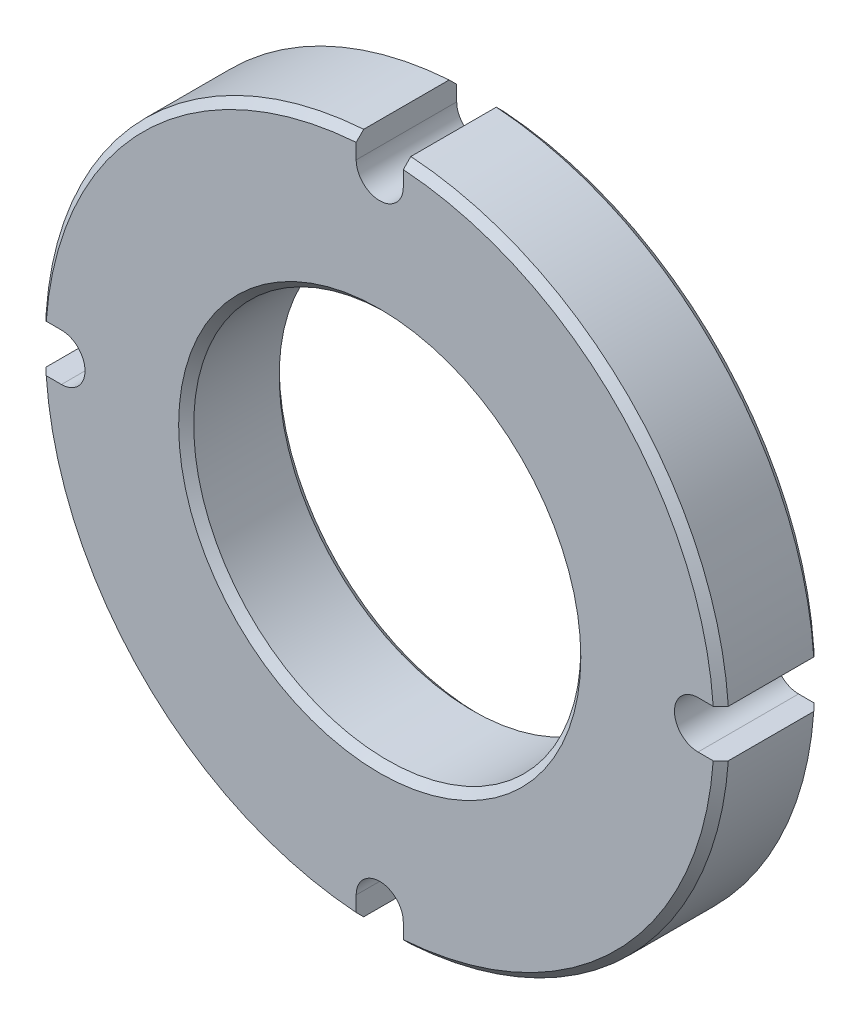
ISO-10303-21;
HEADER;
FILE_DESCRIPTION(('STEP AP214'),'2;1');
FILE_NAME('part.step','',(''),(''),'','','');
FILE_SCHEMA(('AUTOMOTIVE_DESIGN { 1 0 10303 214 1 1 1 1 }'));
ENDSEC;
DATA;
#1=APPLICATION_CONTEXT('core data for automotive mechanical design processes');
#2=APPLICATION_PROTOCOL_DEFINITION('international standard','automotive_design',2000,#1);
#3=PRODUCT_CONTEXT('',#1,'mechanical');
#4=PRODUCT('Part','Part','',(#3));
#5=PRODUCT_RELATED_PRODUCT_CATEGORY('part','',(#4));
#6=PRODUCT_DEFINITION_FORMATION('','',#4);
#7=PRODUCT_DEFINITION_CONTEXT('part definition',#1,'design');
#8=PRODUCT_DEFINITION('design','',#6,#7);
#9=PRODUCT_DEFINITION_SHAPE('','',#8);
#10=(LENGTH_UNIT() NAMED_UNIT(*) SI_UNIT(.MILLI.,.METRE.));
#11=(NAMED_UNIT(*) PLANE_ANGLE_UNIT() SI_UNIT($,.RADIAN.));
#12=(NAMED_UNIT(*) SI_UNIT($,.STERADIAN.) SOLID_ANGLE_UNIT());
#13=UNCERTAINTY_MEASURE_WITH_UNIT(LENGTH_MEASURE(1.E-05),#10,'distance_accuracy_value','');
#14=(GEOMETRIC_REPRESENTATION_CONTEXT(3) GLOBAL_UNCERTAINTY_ASSIGNED_CONTEXT((#13)) GLOBAL_UNIT_ASSIGNED_CONTEXT((#10,
#11,#12)) REPRESENTATION_CONTEXT('',''));
#15=CARTESIAN_POINT('',(0.,0.,0.));
#16=DIRECTION('',(0.,0.,1.));
#17=DIRECTION('',(1.,0.,0.));
#18=AXIS2_PLACEMENT_3D('',#15,#16,#17);
#19=CARTESIAN_POINT('',(0.,0.,2.54));
#20=DIRECTION('',(0.,0.,-1.));
#21=DIRECTION('',(-1.,0.,0.));
#22=AXIS2_PLACEMENT_3D('',#19,#20,#21);
#23=CYLINDRICAL_SURFACE('',#22,17.272);
#24=CARTESIAN_POINT('',(0.,0.,2.159));
#25=DIRECTION('',(0.,0.,1.));
#26=DIRECTION('',(1.,0.,0.));
#27=AXIS2_PLACEMENT_3D('',#24,#25,#26);
#28=CIRCLE('',#27,17.272);
#29=CARTESIAN_POINT('',(1.19062500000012,17.2309139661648,2.159));
#30=VERTEX_POINT('',#29);
#31=CARTESIAN_POINT('',(17.2309139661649,1.19062499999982,2.159));
#32=VERTEX_POINT('',#31);
#33=EDGE_CURVE('E501',#30,#32,#28,.F.);
#34=ORIENTED_EDGE('',*,*,#33,.T.);
#35=DIRECTION('',(0.,0.,-1.));
#36=VECTOR('',#35,1.);
#37=CARTESIAN_POINT('',(17.2309139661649,1.19062499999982,2.54));
#38=LINE('',#37,#36);
#39=CARTESIAN_POINT('',(17.2309139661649,1.19062499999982,-2.15900000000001));
#40=VERTEX_POINT('',#39);
#41=EDGE_CURVE('E238',#32,#40,#38,.T.);
#42=ORIENTED_EDGE('',*,*,#41,.T.);
#43=CARTESIAN_POINT('',(0.,0.,-2.15900000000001));
#44=DIRECTION('',(0.,0.,1.));
#45=DIRECTION('',(1.,0.,0.));
#46=AXIS2_PLACEMENT_3D('',#43,#44,#45);
#47=CIRCLE('',#46,17.272);
#48=CARTESIAN_POINT('',(1.19062500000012,17.2309139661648,-2.15900000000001));
#49=VERTEX_POINT('',#48);
#50=EDGE_CURVE('E415',#40,#49,#47,.T.);
#51=ORIENTED_EDGE('',*,*,#50,.T.);
#52=DIRECTION('',(0.,0.,-1.));
#53=VECTOR('',#52,1.);
#54=CARTESIAN_POINT('',(1.19062500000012,17.2309139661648,2.54));
#55=LINE('',#54,#53);
#56=EDGE_CURVE('E322',#49,#30,#55,.F.);
#57=ORIENTED_EDGE('',*,*,#56,.T.);
#58=EDGE_LOOP('',(#34,#42,#51,#57));
#59=FACE_BOUND('',#58,.T.);
#60=ADVANCED_FACE('F31',(#59),#23,.T.);
#61=CARTESIAN_POINT('',(0.,0.,-2.15900000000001));
#62=DIRECTION('',(0.,0.,1.));
#63=DIRECTION('',(1.,0.,0.));
#64=AXIS2_PLACEMENT_3D('',#61,#62,#63);
#65=CONICAL_SURFACE('',#64,17.272,0.785398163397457);
#66=CARTESIAN_POINT('',(15.2126285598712,1.19062499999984,-4.17185010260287));
#67=CARTESIAN_POINT('',(15.7859811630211,1.19062499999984,-3.6002129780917));
#68=CARTESIAN_POINT('',(16.3592616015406,1.19062499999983,-3.02850350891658));
#69=CARTESIAN_POINT('',(17.505678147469,1.19062499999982,-1.88493988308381));
#70=CARTESIAN_POINT('',(18.0788142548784,1.19062499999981,-1.31308572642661));
#71=CARTESIAN_POINT('',(18.651878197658,1.19062499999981,-0.741159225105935));
#72=B_SPLINE_CURVE_WITH_KNOTS('',3,(#66,#67,#68,#69,#70,#71),.UNSPECIFIED.,.F.,.F.,(4,2,4),(0.,
2.42889267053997,4.85778533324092),.UNSPECIFIED.);
#73=CARTESIAN_POINT('',(16.8489849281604,1.19062499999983,-2.54));
#74=VERTEX_POINT('',#73);
#75=EDGE_CURVE('E465',#74,#40,#72,.T.);
#76=ORIENTED_EDGE('',*,*,#75,.F.);
#77=CARTESIAN_POINT('',(0.,0.,-2.54));
#78=DIRECTION('',(0.,0.,1.));
#79=DIRECTION('',(1.,0.,0.));
#80=AXIS2_PLACEMENT_3D('',#77,#78,#79);
#81=CIRCLE('',#80,16.891);
#82=CARTESIAN_POINT('',(1.19062500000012,16.8489849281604,-2.54));
#83=VERTEX_POINT('',#82);
#84=EDGE_CURVE('E462',#83,#74,#81,.F.);
#85=ORIENTED_EDGE('',*,*,#84,.F.);
#86=CARTESIAN_POINT('',(1.19062500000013,18.651878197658,-0.741159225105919));
#87=CARTESIAN_POINT('',(1.19062500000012,18.0788142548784,-1.3130857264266));
#88=CARTESIAN_POINT('',(1.19062500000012,17.505678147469,-1.8849398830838));
#89=CARTESIAN_POINT('',(1.19062500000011,16.3592616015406,-3.02850350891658));
#90=CARTESIAN_POINT('',(1.19062500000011,15.785981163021,-3.60021297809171));
#91=CARTESIAN_POINT('',(1.1906250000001,15.2126285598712,-4.17185010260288));
#92=B_SPLINE_CURVE_WITH_KNOTS('',3,(#86,#87,#88,#89,#90,#91),.UNSPECIFIED.,.F.,.F.,(4,2,4),(0.,
2.42889266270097,4.85778533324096),.UNSPECIFIED.);
#93=EDGE_CURVE('E315',#49,#83,#92,.T.);
#94=ORIENTED_EDGE('',*,*,#93,.F.);
#95=ORIENTED_EDGE('',*,*,#50,.F.);
#96=EDGE_LOOP('',(#76,#85,#94,#95));
#97=FACE_BOUND('',#96,.T.);
#98=ADVANCED_FACE('F469',(#97),#65,.T.);
#99=CARTESIAN_POINT('',(0.,0.,2.54));
#100=DIRECTION('',(0.,0.,-1.));
#101=DIRECTION('',(-1.,0.,0.));
#102=AXIS2_PLACEMENT_3D('',#99,#100,#101);
#103=CONICAL_SURFACE('',#102,16.891,0.785398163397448);
#104=CARTESIAN_POINT('',(18.651878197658,1.19062499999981,0.741159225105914));
#105=CARTESIAN_POINT('',(18.0788142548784,1.19062499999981,1.3130857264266));
#106=CARTESIAN_POINT('',(17.505678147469,1.19062499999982,1.8849398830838));
#107=CARTESIAN_POINT('',(16.3592616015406,1.19062499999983,3.02850350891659));
#108=CARTESIAN_POINT('',(15.7859811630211,1.19062499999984,3.60021297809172));
#109=CARTESIAN_POINT('',(15.2126285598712,1.19062499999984,4.17185010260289));
#110=B_SPLINE_CURVE_WITH_KNOTS('',3,(#104,#105,#106,#107,#108,#109),.UNSPECIFIED.,.F.,.F.,(4,2,
4),(0.,2.42889266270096,4.85778533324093),.UNSPECIFIED.);
#111=CARTESIAN_POINT('',(16.8489849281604,1.19062499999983,2.54));
#112=VERTEX_POINT('',#111);
#113=EDGE_CURVE('E11',#32,#112,#110,.T.);
#114=ORIENTED_EDGE('',*,*,#113,.F.);
#115=ORIENTED_EDGE('',*,*,#33,.F.);
#116=CARTESIAN_POINT('',(1.1906250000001,15.2126285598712,4.1718501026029));
#117=CARTESIAN_POINT('',(1.19062500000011,15.785981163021,3.60021297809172));
#118=CARTESIAN_POINT('',(1.19062500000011,16.3592616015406,3.02850350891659));
#119=CARTESIAN_POINT('',(1.19062500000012,17.505678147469,1.88493988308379));
#120=CARTESIAN_POINT('',(1.19062500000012,18.0788142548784,1.31308572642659));
#121=CARTESIAN_POINT('',(1.19062500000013,18.651878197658,0.741159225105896));
#122=B_SPLINE_CURVE_WITH_KNOTS('',3,(#116,#117,#118,#119,#120,#121),.UNSPECIFIED.,.F.,.F.,(4,2,
4),(0.,2.42889267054,4.85778533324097),.UNSPECIFIED.);
#123=CARTESIAN_POINT('',(1.19062500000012,16.8489849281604,2.54));
#124=VERTEX_POINT('',#123);
#125=EDGE_CURVE('E300',#124,#30,#122,.T.);
#126=ORIENTED_EDGE('',*,*,#125,.F.);
#127=CARTESIAN_POINT('',(0.,0.,2.54));
#128=DIRECTION('',(0.,0.,1.));
#129=DIRECTION('',(1.,0.,0.));
#130=AXIS2_PLACEMENT_3D('',#127,#128,#129);
#131=CIRCLE('',#130,16.891);
#132=EDGE_CURVE('E59',#112,#124,#131,.T.);
#133=ORIENTED_EDGE('',*,*,#132,.F.);
#134=EDGE_LOOP('',(#114,#115,#126,#133));
#135=FACE_BOUND('',#134,.T.);
#136=ADVANCED_FACE('F265',(#135),#103,.T.);
#137=CARTESIAN_POINT('',(-17.2309139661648,1.19062500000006,2.159));
#138=VERTEX_POINT('',#137);
#139=CARTESIAN_POINT('',(-1.19062499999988,17.2309139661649,2.159));
#140=VERTEX_POINT('',#139);
#141=EDGE_CURVE('E410',#138,#140,#28,.F.);
#142=ORIENTED_EDGE('',*,*,#141,.T.);
#143=DIRECTION('',(0.,0.,-1.));
#144=VECTOR('',#143,1.);
#145=CARTESIAN_POINT('',(-1.19062499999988,17.2309139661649,2.54));
#146=LINE('',#145,#144);
#147=CARTESIAN_POINT('',(-1.19062499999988,17.2309139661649,-2.15900000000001));
#148=VERTEX_POINT('',#147);
#149=EDGE_CURVE('E321',#140,#148,#146,.T.);
#150=ORIENTED_EDGE('',*,*,#149,.T.);
#151=CARTESIAN_POINT('',(-17.2309139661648,1.19062500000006,-2.15900000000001));
#152=VERTEX_POINT('',#151);
#153=EDGE_CURVE('E514',#148,#152,#47,.T.);
#154=ORIENTED_EDGE('',*,*,#153,.T.);
#155=DIRECTION('',(0.,0.,-1.));
#156=VECTOR('',#155,1.);
#157=CARTESIAN_POINT('',(-17.2309139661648,1.19062500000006,2.54));
#158=LINE('',#157,#156);
#159=EDGE_CURVE('E352',#152,#138,#158,.F.);
#160=ORIENTED_EDGE('',*,*,#159,.T.);
#161=EDGE_LOOP('',(#142,#150,#154,#160));
#162=FACE_BOUND('',#161,.T.);
#163=ADVANCED_FACE('F499',(#162),#23,.T.);
#164=CARTESIAN_POINT('',(-1.1906249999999,15.2126285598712,-4.17185010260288));
#165=CARTESIAN_POINT('',(-1.19062499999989,15.7859811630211,-3.60021297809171));
#166=CARTESIAN_POINT('',(-1.19062499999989,16.3592616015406,-3.02850350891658));
#167=CARTESIAN_POINT('',(-1.19062499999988,17.5056781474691,-1.8849398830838));
#168=CARTESIAN_POINT('',(-1.19062499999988,18.0788142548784,-1.31308572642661));
#169=CARTESIAN_POINT('',(-1.19062499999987,18.651878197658,-0.741159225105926));
#170=B_SPLINE_CURVE_WITH_KNOTS('',3,(#164,#165,#166,#167,#168,#169),.UNSPECIFIED.,.F.,.F.,(4,2,
4),(0.,2.42889267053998,4.85778533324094),.UNSPECIFIED.);
#171=CARTESIAN_POINT('',(-1.19062499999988,16.8489849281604,-2.54));
#172=VERTEX_POINT('',#171);
#173=EDGE_CURVE('E326',#172,#148,#170,.T.);
#174=ORIENTED_EDGE('',*,*,#173,.F.);
#175=CARTESIAN_POINT('',(-16.8489849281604,1.19062500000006,-2.54));
#176=VERTEX_POINT('',#175);
#177=EDGE_CURVE('E396',#176,#172,#81,.F.);
#178=ORIENTED_EDGE('',*,*,#177,.F.);
#179=CARTESIAN_POINT('',(-18.8010404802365,1.19062500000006,-0.592297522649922));
#180=CARTESIAN_POINT('',(-18.2279852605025,1.19062500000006,-1.16423276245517));
#181=CARTESIAN_POINT('',(-17.6548597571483,1.19062500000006,-1.73609754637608));
#182=CARTESIAN_POINT('',(-16.5084681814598,1.19062500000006,-2.87968620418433));
#183=CARTESIAN_POINT('',(-15.9352021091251,1.19062500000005,-3.45141007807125));
#184=CARTESIAN_POINT('',(-15.3618657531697,1.19062500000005,-4.02306349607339));
#185=B_SPLINE_CURVE_WITH_KNOTS('',3,(#179,#180,#181,#182,#183,#184),.UNSPECIFIED.,.F.,.F.,(4,2,
4),(0.,2.42889266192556,4.85778533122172),.UNSPECIFIED.);
#186=EDGE_CURVE('E356',#152,#176,#185,.T.);
#187=ORIENTED_EDGE('',*,*,#186,.F.);
#188=ORIENTED_EDGE('',*,*,#153,.F.);
#189=EDGE_LOOP('',(#174,#178,#187,#188));
#190=FACE_BOUND('',#189,.T.);
#191=ADVANCED_FACE('F513',(#190),#65,.T.);
#192=CARTESIAN_POINT('',(-1.19062499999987,18.651878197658,0.741159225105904));
#193=CARTESIAN_POINT('',(-1.19062499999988,18.0788142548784,1.31308572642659));
#194=CARTESIAN_POINT('',(-1.19062499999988,17.505678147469,1.88493988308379));
#195=CARTESIAN_POINT('',(-1.19062499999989,16.3592616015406,3.02850350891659));
#196=CARTESIAN_POINT('',(-1.19062499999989,15.7859811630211,3.60021297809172));
#197=CARTESIAN_POINT('',(-1.1906249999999,15.2126285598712,4.17185010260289));
#198=B_SPLINE_CURVE_WITH_KNOTS('',3,(#192,#193,#194,#195,#196,#197),.UNSPECIFIED.,.F.,.F.,(4,2,
4),(0.,2.42889266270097,4.85778533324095),.UNSPECIFIED.);
#199=CARTESIAN_POINT('',(-1.19062499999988,16.8489849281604,2.54));
#200=VERTEX_POINT('',#199);
#201=EDGE_CURVE('E254',#140,#200,#198,.T.);
#202=ORIENTED_EDGE('',*,*,#201,.F.);
#203=ORIENTED_EDGE('',*,*,#141,.F.);
#204=CARTESIAN_POINT('',(-15.3618657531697,1.19062500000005,4.02306349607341));
#205=CARTESIAN_POINT('',(-15.9352021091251,1.19062500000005,3.45141007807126));
#206=CARTESIAN_POINT('',(-16.5084681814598,1.19062500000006,2.87968620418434));
#207=CARTESIAN_POINT('',(-17.6548597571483,1.19062500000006,1.73609754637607));
#208=CARTESIAN_POINT('',(-18.2279852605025,1.19062500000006,1.16423276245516));
#209=CARTESIAN_POINT('',(-18.8010404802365,1.19062500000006,0.592297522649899));
#210=B_SPLINE_CURVE_WITH_KNOTS('',3,(#204,#205,#206,#207,#208,#209),.UNSPECIFIED.,.F.,.F.,(4,2,
4),(0.,2.42889266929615,4.85778533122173),.UNSPECIFIED.);
#211=CARTESIAN_POINT('',(-16.8489849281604,1.19062500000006,2.54));
#212=VERTEX_POINT('',#211);
#213=EDGE_CURVE('E287',#212,#138,#210,.T.);
#214=ORIENTED_EDGE('',*,*,#213,.F.);
#215=EDGE_CURVE('E418',#200,#212,#131,.T.);
#216=ORIENTED_EDGE('',*,*,#215,.F.);
#217=EDGE_LOOP('',(#202,#203,#214,#216));
#218=FACE_BOUND('',#217,.T.);
#219=ADVANCED_FACE('F435',(#218),#103,.T.);
#220=CARTESIAN_POINT('',(-1.190625,-17.2309139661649,2.159));
#221=VERTEX_POINT('',#220);
#222=CARTESIAN_POINT('',(-17.2309139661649,-1.19062499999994,2.159));
#223=VERTEX_POINT('',#222);
#224=EDGE_CURVE('E406',#221,#223,#28,.F.);
#225=ORIENTED_EDGE('',*,*,#224,.T.);
#226=DIRECTION('',(0.,0.,-1.));
#227=VECTOR('',#226,1.);
#228=CARTESIAN_POINT('',(-17.2309139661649,-1.19062499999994,2.54));
#229=LINE('',#228,#227);
#230=CARTESIAN_POINT('',(-17.2309139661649,-1.19062499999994,-2.15900000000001));
#231=VERTEX_POINT('',#230);
#232=EDGE_CURVE('E361',#223,#231,#229,.T.);
#233=ORIENTED_EDGE('',*,*,#232,.T.);
#234=CARTESIAN_POINT('',(-1.190625,-17.2309139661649,-2.15900000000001));
#235=VERTEX_POINT('',#234);
#236=EDGE_CURVE('E409',#231,#235,#47,.T.);
#237=ORIENTED_EDGE('',*,*,#236,.T.);
#238=DIRECTION('',(0.,0.,-1.));
#239=VECTOR('',#238,1.);
#240=CARTESIAN_POINT('',(-1.190625,-17.2309139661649,2.54));
#241=LINE('',#240,#239);
#242=EDGE_CURVE('E521',#235,#221,#241,.F.);
#243=ORIENTED_EDGE('',*,*,#242,.T.);
#244=EDGE_LOOP('',(#225,#233,#237,#243));
#245=FACE_BOUND('',#244,.T.);
#246=ADVANCED_FACE('F520',(#245),#23,.T.);
#247=CARTESIAN_POINT('',(-15.3618657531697,-1.19062499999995,-4.02306349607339));
#248=CARTESIAN_POINT('',(-15.9352021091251,-1.19062499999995,-3.45141007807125));
#249=CARTESIAN_POINT('',(-16.5084681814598,-1.19062499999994,-2.87968620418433));
#250=CARTESIAN_POINT('',(-17.6548597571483,-1.19062499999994,-1.73609754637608));
#251=CARTESIAN_POINT('',(-18.2279852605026,-1.19062499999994,-1.16423276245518));
#252=CARTESIAN_POINT('',(-18.8010404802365,-1.19062499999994,-0.592297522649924));
#253=B_SPLINE_CURVE_WITH_KNOTS('',3,(#247,#248,#249,#250,#251,#252),.UNSPECIFIED.,.F.,.F.,(4,2,
4),(0.,2.42889266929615,4.85778533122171),.UNSPECIFIED.);
#254=CARTESIAN_POINT('',(-16.8489849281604,-1.19062499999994,-2.54));
#255=VERTEX_POINT('',#254);
#256=EDGE_CURVE('E549',#255,#231,#253,.T.);
#257=ORIENTED_EDGE('',*,*,#256,.F.);
#258=CARTESIAN_POINT('',(-1.190625,-16.8489849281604,-2.54));
#259=VERTEX_POINT('',#258);
#260=EDGE_CURVE('E392',#259,#255,#81,.F.);
#261=ORIENTED_EDGE('',*,*,#260,.F.);
#262=CARTESIAN_POINT('',(-1.190625,-18.8010404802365,-0.592297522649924));
#263=CARTESIAN_POINT('',(-1.190625,-18.2279852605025,-1.16423276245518));
#264=CARTESIAN_POINT('',(-1.190625,-17.6548597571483,-1.73609754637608));
#265=CARTESIAN_POINT('',(-1.190625,-16.5084681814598,-2.87968620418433));
#266=CARTESIAN_POINT('',(-1.190625,-15.9352021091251,-3.45141007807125));
#267=CARTESIAN_POINT('',(-1.190625,-15.3618657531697,-4.0230634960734));
#268=B_SPLINE_CURVE_WITH_KNOTS('',3,(#262,#263,#264,#265,#266,#267),.UNSPECIFIED.,.F.,.F.,(4,2,
4),(0.,2.42889266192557,4.85778533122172),.UNSPECIFIED.);
#269=EDGE_CURVE('E528',#235,#259,#268,.T.);
#270=ORIENTED_EDGE('',*,*,#269,.F.);
#271=ORIENTED_EDGE('',*,*,#236,.F.);
#272=EDGE_LOOP('',(#257,#261,#270,#271));
#273=FACE_BOUND('',#272,.T.);
#274=ADVANCED_FACE('F534',(#273),#65,.T.);
#275=CARTESIAN_POINT('',(-18.8010404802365,-1.19062499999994,0.592297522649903));
#276=CARTESIAN_POINT('',(-18.2279852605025,-1.19062499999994,1.16423276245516));
#277=CARTESIAN_POINT('',(-17.6548597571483,-1.19062499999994,1.73609754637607));
#278=CARTESIAN_POINT('',(-16.5084681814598,-1.19062499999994,2.87968620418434));
#279=CARTESIAN_POINT('',(-15.9352021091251,-1.19062499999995,3.45141007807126));
#280=CARTESIAN_POINT('',(-15.3618657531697,-1.19062499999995,4.02306349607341));
#281=B_SPLINE_CURVE_WITH_KNOTS('',3,(#275,#276,#277,#278,#279,#280),.UNSPECIFIED.,.F.,.F.,(4,2,
4),(0.,2.42889266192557,4.85778533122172),.UNSPECIFIED.);
#282=CARTESIAN_POINT('',(-16.8489849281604,-1.19062499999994,2.54));
#283=VERTEX_POINT('',#282);
#284=EDGE_CURVE('E294',#223,#283,#281,.T.);
#285=ORIENTED_EDGE('',*,*,#284,.F.);
#286=ORIENTED_EDGE('',*,*,#224,.F.);
#287=CARTESIAN_POINT('',(-1.190625,-15.3618657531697,4.02306349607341));
#288=CARTESIAN_POINT('',(-1.190625,-15.9352021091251,3.45141007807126));
#289=CARTESIAN_POINT('',(-1.190625,-16.5084681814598,2.87968620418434));
#290=CARTESIAN_POINT('',(-1.190625,-17.6548597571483,1.73609754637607));
#291=CARTESIAN_POINT('',(-1.190625,-18.2279852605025,1.16423276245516));
#292=CARTESIAN_POINT('',(-1.190625,-18.8010404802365,0.592297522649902));
#293=B_SPLINE_CURVE_WITH_KNOTS('',3,(#287,#288,#289,#290,#291,#292),.UNSPECIFIED.,.F.,.F.,(4,2,
4),(0.,2.42889266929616,4.85778533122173),.UNSPECIFIED.);
#294=CARTESIAN_POINT('',(-1.190625,-16.8489849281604,2.54));
#295=VERTEX_POINT('',#294);
#296=EDGE_CURVE('E271',#295,#221,#293,.T.);
#297=ORIENTED_EDGE('',*,*,#296,.F.);
#298=EDGE_CURVE('E417',#283,#295,#131,.T.);
#299=ORIENTED_EDGE('',*,*,#298,.F.);
#300=EDGE_LOOP('',(#285,#286,#297,#299));
#301=FACE_BOUND('',#300,.T.);
#302=ADVANCED_FACE('F266',(#301),#103,.T.);
#303=CARTESIAN_POINT('',(0.,0.,2.54));
#304=DIRECTION('',(0.,0.,1.));
#305=DIRECTION('',(1.,0.,0.));
#306=AXIS2_PLACEMENT_3D('',#303,#304,#305);
#307=PLANE('',#306);
#308=DIRECTION('',(-1.,0.,0.));
#309=VECTOR('',#308,1.);
#310=CARTESIAN_POINT('',(17.272,1.19062499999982,2.54));
#311=LINE('',#310,#309);
#312=CARTESIAN_POINT('',(16.081375,1.19062499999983,2.54));
#313=VERTEX_POINT('',#312);
#314=EDGE_CURVE('E218',#112,#313,#311,.T.);
#315=ORIENTED_EDGE('',*,*,#314,.F.);
#316=ORIENTED_EDGE('',*,*,#132,.T.);
#317=DIRECTION('',(0.,1.,0.));
#318=VECTOR('',#317,1.);
#319=CARTESIAN_POINT('',(1.19062500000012,17.272,2.54));
#320=LINE('',#319,#318);
#321=CARTESIAN_POINT('',(1.19062500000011,16.081375,2.54));
#322=VERTEX_POINT('',#321);
#323=EDGE_CURVE('E473',#322,#124,#320,.T.);
#324=ORIENTED_EDGE('',*,*,#323,.F.);
#325=CARTESIAN_POINT('',(1.14216440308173E-13,16.081375,2.54));
#326=DIRECTION('',(0.,0.,1.));
#327=DIRECTION('',(1.,0.,0.));
#328=AXIS2_PLACEMENT_3D('',#325,#326,#327);
#329=CIRCLE('',#328,1.190625);
#330=CARTESIAN_POINT('',(-1.19062499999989,16.081375,2.54));
#331=VERTEX_POINT('',#330);
#332=EDGE_CURVE('E471',#331,#322,#329,.T.);
#333=ORIENTED_EDGE('',*,*,#332,.F.);
#334=DIRECTION('',(0.,-1.,0.));
#335=VECTOR('',#334,1.);
#336=CARTESIAN_POINT('',(-1.19062499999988,17.272,2.54));
#337=LINE('',#336,#335);
#338=EDGE_CURVE('E428',#200,#331,#337,.T.);
#339=ORIENTED_EDGE('',*,*,#338,.F.);
#340=ORIENTED_EDGE('',*,*,#215,.T.);
#341=DIRECTION('',(-1.,0.,0.));
#342=VECTOR('',#341,1.);
#343=CARTESIAN_POINT('',(-17.272,1.19062500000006,2.54));
#344=LINE('',#343,#342);
#345=CARTESIAN_POINT('',(-16.081375,1.19062500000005,2.54));
#346=VERTEX_POINT('',#345);
#347=EDGE_CURVE('E334',#346,#212,#344,.T.);
#348=ORIENTED_EDGE('',*,*,#347,.F.);
#349=CARTESIAN_POINT('',(-16.081375,0.,2.54));
#350=DIRECTION('',(0.,0.,1.));
#351=DIRECTION('',(0.,1.,0.));
#352=AXIS2_PLACEMENT_3D('',#349,#350,#351);
#353=CIRCLE('',#352,1.190625);
#354=CARTESIAN_POINT('',(-16.081375,-1.19062499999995,2.54));
#355=VERTEX_POINT('',#354);
#356=EDGE_CURVE('E331',#355,#346,#353,.T.);
#357=ORIENTED_EDGE('',*,*,#356,.F.);
#358=DIRECTION('',(1.,0.,0.));
#359=VECTOR('',#358,1.);
#360=CARTESIAN_POINT('',(-17.272,-1.19062499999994,2.54));
#361=LINE('',#360,#359);
#362=EDGE_CURVE('E337',#283,#355,#361,.T.);
#363=ORIENTED_EDGE('',*,*,#362,.F.);
#364=ORIENTED_EDGE('',*,*,#298,.T.);
#365=DIRECTION('',(0.,-1.,0.));
#366=VECTOR('',#365,1.);
#367=CARTESIAN_POINT('',(-1.190625,-17.272,2.54));
#368=LINE('',#367,#366);
#369=CARTESIAN_POINT('',(-1.190625,-16.081375,2.54));
#370=VERTEX_POINT('',#369);
#371=EDGE_CURVE('E447',#370,#295,#368,.T.);
#372=ORIENTED_EDGE('',*,*,#371,.F.);
#373=CARTESIAN_POINT('',(0.,-16.081375,2.54));
#374=DIRECTION('',(0.,0.,1.));
#375=DIRECTION('',(-1.,0.,0.));
#376=AXIS2_PLACEMENT_3D('',#373,#374,#375);
#377=CIRCLE('',#376,1.190625);
#378=CARTESIAN_POINT('',(1.190625,-16.081375,2.54));
#379=VERTEX_POINT('',#378);
#380=EDGE_CURVE('E445',#379,#370,#377,.T.);
#381=ORIENTED_EDGE('',*,*,#380,.F.);
#382=DIRECTION('',(0.,1.,0.));
#383=VECTOR('',#382,1.);
#384=CARTESIAN_POINT('',(1.190625,-17.272,2.54));
#385=LINE('',#384,#383);
#386=CARTESIAN_POINT('',(1.190625,-16.8489849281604,2.54));
#387=VERTEX_POINT('',#386);
#388=EDGE_CURVE('E439',#387,#379,#385,.T.);
#389=ORIENTED_EDGE('',*,*,#388,.F.);
#390=CARTESIAN_POINT('',(16.8489849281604,-1.19062500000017,2.54));
#391=VERTEX_POINT('',#390);
#392=EDGE_CURVE('E217',#387,#391,#131,.T.);
#393=ORIENTED_EDGE('',*,*,#392,.T.);
#394=DIRECTION('',(1.,0.,0.));
#395=VECTOR('',#394,1.);
#396=CARTESIAN_POINT('',(17.272,-1.19062500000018,2.54));
#397=LINE('',#396,#395);
#398=CARTESIAN_POINT('',(16.081375,-1.19062500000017,2.54));
#399=VERTEX_POINT('',#398);
#400=EDGE_CURVE('E51',#399,#391,#397,.T.);
#401=ORIENTED_EDGE('',*,*,#400,.F.);
#402=CARTESIAN_POINT('',(16.081375,-1.70364293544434E-13,2.54));
#403=DIRECTION('',(0.,0.,1.));
#404=DIRECTION('',(0.,-1.,0.));
#405=AXIS2_PLACEMENT_3D('',#402,#403,#404);
#406=CIRCLE('',#405,1.190625);
#407=EDGE_CURVE('E209',#313,#399,#406,.T.);
#408=ORIENTED_EDGE('',*,*,#407,.F.);
#409=EDGE_LOOP('',(#315,#316,#324,#333,#339,#340,#348,#357,#363,#364,#372,#381,#389,#393,#401,#408));
#410=FACE_BOUND('',#409,.T.);
#411=CARTESIAN_POINT('',(0.,0.,2.54));
#412=DIRECTION('',(0.,0.,1.));
#413=DIRECTION('',(1.,0.,0.));
#414=AXIS2_PLACEMENT_3D('',#411,#412,#413);
#415=CIRCLE('',#414,10.16);
#416=CARTESIAN_POINT('',(10.16,0.,2.54));
#417=VERTEX_POINT('',#416);
#418=EDGE_CURVE('E414',#417,#417,#415,.F.);
#419=ORIENTED_EDGE('',*,*,#418,.T.);
#420=EDGE_LOOP('',(#419));
#421=FACE_BOUND('',#420,.T.);
#422=ADVANCED_FACE('F213',(#410,#421),#307,.T.);
#423=CARTESIAN_POINT('',(0.,0.,-2.54));
#424=DIRECTION('',(0.,0.,1.));
#425=DIRECTION('',(1.,0.,0.));
#426=AXIS2_PLACEMENT_3D('',#423,#424,#425);
#427=PLANE('',#426);
#428=CARTESIAN_POINT('',(0.,0.,-2.54));
#429=DIRECTION('',(0.,0.,1.));
#430=DIRECTION('',(1.,0.,0.));
#431=AXIS2_PLACEMENT_3D('',#428,#429,#430);
#432=CIRCLE('',#431,10.16);
#433=CARTESIAN_POINT('',(10.16,0.,-2.54));
#434=VERTEX_POINT('',#433);
#435=EDGE_CURVE('E395',#434,#434,#432,.T.);
#436=ORIENTED_EDGE('',*,*,#435,.T.);
#437=EDGE_LOOP('',(#436));
#438=FACE_BOUND('',#437,.T.);
#439=ORIENTED_EDGE('',*,*,#84,.T.);
#440=DIRECTION('',(-1.,0.,0.));
#441=VECTOR('',#440,1.);
#442=CARTESIAN_POINT('',(17.272,1.19062499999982,-2.54));
#443=LINE('',#442,#441);
#444=CARTESIAN_POINT('',(16.081375,1.19062499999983,-2.54));
#445=VERTEX_POINT('',#444);
#446=EDGE_CURVE('E205',#74,#445,#443,.T.);
#447=ORIENTED_EDGE('',*,*,#446,.T.);
#448=CARTESIAN_POINT('',(16.081375,-1.70364293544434E-13,-2.54));
#449=DIRECTION('',(0.,0.,1.));
#450=DIRECTION('',(0.,-1.,0.));
#451=AXIS2_PLACEMENT_3D('',#448,#449,#450);
#452=CIRCLE('',#451,1.190625);
#453=CARTESIAN_POINT('',(16.081375,-1.19062500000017,-2.54));
#454=VERTEX_POINT('',#453);
#455=EDGE_CURVE('E220',#445,#454,#452,.T.);
#456=ORIENTED_EDGE('',*,*,#455,.T.);
#457=DIRECTION('',(1.,0.,0.));
#458=VECTOR('',#457,1.);
#459=CARTESIAN_POINT('',(17.272,-1.19062500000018,-2.54));
#460=LINE('',#459,#458);
#461=CARTESIAN_POINT('',(16.8489849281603,-1.19062500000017,-2.54));
#462=VERTEX_POINT('',#461);
#463=EDGE_CURVE('E200',#454,#462,#460,.T.);
#464=ORIENTED_EDGE('',*,*,#463,.T.);
#465=CARTESIAN_POINT('',(1.190625,-16.8489849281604,-2.54));
#466=VERTEX_POINT('',#465);
#467=EDGE_CURVE('E389',#462,#466,#81,.F.);
#468=ORIENTED_EDGE('',*,*,#467,.T.);
#469=DIRECTION('',(0.,1.,0.));
#470=VECTOR('',#469,1.);
#471=CARTESIAN_POINT('',(1.190625,-17.272,-2.54));
#472=LINE('',#471,#470);
#473=CARTESIAN_POINT('',(1.190625,-16.081375,-2.54));
#474=VERTEX_POINT('',#473);
#475=EDGE_CURVE('E541',#466,#474,#472,.T.);
#476=ORIENTED_EDGE('',*,*,#475,.T.);
#477=CARTESIAN_POINT('',(0.,-16.081375,-2.54));
#478=DIRECTION('',(0.,0.,1.));
#479=DIRECTION('',(-1.,0.,0.));
#480=AXIS2_PLACEMENT_3D('',#477,#478,#479);
#481=CIRCLE('',#480,1.190625);
#482=CARTESIAN_POINT('',(-1.190625,-16.081375,-2.54));
#483=VERTEX_POINT('',#482);
#484=EDGE_CURVE('E446',#474,#483,#481,.T.);
#485=ORIENTED_EDGE('',*,*,#484,.T.);
#486=DIRECTION('',(0.,-1.,0.));
#487=VECTOR('',#486,1.);
#488=CARTESIAN_POINT('',(-1.190625,-17.272,-2.54));
#489=LINE('',#488,#487);
#490=EDGE_CURVE('E544',#483,#259,#489,.T.);
#491=ORIENTED_EDGE('',*,*,#490,.T.);
#492=ORIENTED_EDGE('',*,*,#260,.T.);
#493=DIRECTION('',(1.,0.,0.));
#494=VECTOR('',#493,1.);
#495=CARTESIAN_POINT('',(-17.272,-1.19062499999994,-2.54));
#496=LINE('',#495,#494);
#497=CARTESIAN_POINT('',(-16.081375,-1.19062499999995,-2.54));
#498=VERTEX_POINT('',#497);
#499=EDGE_CURVE('E345',#255,#498,#496,.T.);
#500=ORIENTED_EDGE('',*,*,#499,.T.);
#501=CARTESIAN_POINT('',(-16.081375,0.,-2.54));
#502=DIRECTION('',(0.,0.,1.));
#503=DIRECTION('',(0.,1.,0.));
#504=AXIS2_PLACEMENT_3D('',#501,#502,#503);
#505=CIRCLE('',#504,1.190625);
#506=CARTESIAN_POINT('',(-16.081375,1.19062500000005,-2.54));
#507=VERTEX_POINT('',#506);
#508=EDGE_CURVE('E339',#498,#507,#505,.T.);
#509=ORIENTED_EDGE('',*,*,#508,.T.);
#510=DIRECTION('',(-1.,0.,0.));
#511=VECTOR('',#510,1.);
#512=CARTESIAN_POINT('',(-17.272,1.19062500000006,-2.54));
#513=LINE('',#512,#511);
#514=EDGE_CURVE('E342',#507,#176,#513,.T.);
#515=ORIENTED_EDGE('',*,*,#514,.T.);
#516=ORIENTED_EDGE('',*,*,#177,.T.);
#517=DIRECTION('',(0.,-1.,0.));
#518=VECTOR('',#517,1.);
#519=CARTESIAN_POINT('',(-1.19062499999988,17.272,-2.54));
#520=LINE('',#519,#518);
#521=CARTESIAN_POINT('',(-1.19062499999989,16.081375,-2.54));
#522=VERTEX_POINT('',#521);
#523=EDGE_CURVE('E486',#172,#522,#520,.T.);
#524=ORIENTED_EDGE('',*,*,#523,.T.);
#525=CARTESIAN_POINT('',(1.14216440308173E-13,16.081375,-2.54));
#526=DIRECTION('',(0.,0.,1.));
#527=DIRECTION('',(1.,0.,0.));
#528=AXIS2_PLACEMENT_3D('',#525,#526,#527);
#529=CIRCLE('',#528,1.190625);
#530=CARTESIAN_POINT('',(1.19062500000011,16.081375,-2.54));
#531=VERTEX_POINT('',#530);
#532=EDGE_CURVE('E481',#522,#531,#529,.T.);
#533=ORIENTED_EDGE('',*,*,#532,.T.);
#534=DIRECTION('',(0.,1.,0.));
#535=VECTOR('',#534,1.);
#536=CARTESIAN_POINT('',(1.19062500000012,17.272,-2.54));
#537=LINE('',#536,#535);
#538=EDGE_CURVE('E484',#531,#83,#537,.T.);
#539=ORIENTED_EDGE('',*,*,#538,.T.);
#540=EDGE_LOOP('',(#439,#447,#456,#464,#468,#476,#485,#491,#492,#500,#509,#515,#516,#524,#533,#539));
#541=FACE_BOUND('',#540,.T.);
#542=ADVANCED_FACE('F457',(#438,#541),#427,.F.);
#543=CARTESIAN_POINT('',(1.190625,-17.2309139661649,-2.15900000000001));
#544=VERTEX_POINT('',#543);
#545=CARTESIAN_POINT('',(17.2309139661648,-1.19062500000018,-2.15900000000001));
#546=VERTEX_POINT('',#545);
#547=EDGE_CURVE('E411',#544,#546,#47,.T.);
#548=ORIENTED_EDGE('',*,*,#547,.T.);
#549=DIRECTION('',(0.,0.,-1.));
#550=VECTOR('',#549,1.);
#551=CARTESIAN_POINT('',(17.2309139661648,-1.19062500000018,2.54));
#552=LINE('',#551,#550);
#553=CARTESIAN_POINT('',(17.2309139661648,-1.19062500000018,2.159));
#554=VERTEX_POINT('',#553);
#555=EDGE_CURVE('E227',#546,#554,#552,.F.);
#556=ORIENTED_EDGE('',*,*,#555,.T.);
#557=CARTESIAN_POINT('',(1.190625,-17.2309139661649,2.159));
#558=VERTEX_POINT('',#557);
#559=EDGE_CURVE('E405',#554,#558,#28,.F.);
#560=ORIENTED_EDGE('',*,*,#559,.T.);
#561=DIRECTION('',(0.,0.,-1.));
#562=VECTOR('',#561,1.);
#563=CARTESIAN_POINT('',(1.190625,-17.2309139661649,2.54));
#564=LINE('',#563,#562);
#565=EDGE_CURVE('E390',#558,#544,#564,.T.);
#566=ORIENTED_EDGE('',*,*,#565,.T.);
#567=EDGE_LOOP('',(#548,#556,#560,#566));
#568=FACE_BOUND('',#567,.T.);
#569=ADVANCED_FACE('F33',(#568),#23,.T.);
#570=CARTESIAN_POINT('',(0.,0.,2.54));
#571=DIRECTION('',(0.,0.,-1.));
#572=DIRECTION('',(-1.,0.,0.));
#573=AXIS2_PLACEMENT_3D('',#570,#571,#572);
#574=CYLINDRICAL_SURFACE('',#573,9.779);
#575=CARTESIAN_POINT('',(0.,0.,-2.15899999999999));
#576=DIRECTION('',(0.,0.,1.));
#577=DIRECTION('',(1.,0.,0.));
#578=AXIS2_PLACEMENT_3D('',#575,#576,#577);
#579=CIRCLE('',#578,9.779);
#580=CARTESIAN_POINT('',(9.779,0.,-2.15899999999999));
#581=VERTEX_POINT('',#580);
#582=EDGE_CURVE('E402',#581,#581,#579,.F.);
#583=ORIENTED_EDGE('',*,*,#582,.T.);
#584=EDGE_LOOP('',(#583));
#585=FACE_BOUND('',#584,.T.);
#586=CARTESIAN_POINT('',(0.,0.,2.15900000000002));
#587=DIRECTION('',(0.,0.,1.));
#588=DIRECTION('',(1.,0.,0.));
#589=AXIS2_PLACEMENT_3D('',#586,#587,#588);
#590=CIRCLE('',#589,9.779);
#591=CARTESIAN_POINT('',(9.779,0.,2.15900000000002));
#592=VERTEX_POINT('',#591);
#593=EDGE_CURVE('E399',#592,#592,#590,.T.);
#594=ORIENTED_EDGE('',*,*,#593,.T.);
#595=EDGE_LOOP('',(#594));
#596=FACE_BOUND('',#595,.T.);
#597=ADVANCED_FACE('F568',(#585,#596),#574,.F.);
#598=CARTESIAN_POINT('',(0.,0.,-2.54));
#599=DIRECTION('',(0.,0.,-1.));
#600=DIRECTION('',(-1.,0.,0.));
#601=AXIS2_PLACEMENT_3D('',#598,#599,#600);
#602=CONICAL_SURFACE('',#601,10.16,0.785398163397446);
#603=ORIENTED_EDGE('',*,*,#582,.F.);
#604=EDGE_LOOP('',(#603));
#605=FACE_BOUND('',#604,.T.);
#606=ORIENTED_EDGE('',*,*,#435,.F.);
#607=EDGE_LOOP('',(#606));
#608=FACE_BOUND('',#607,.T.);
#609=ADVANCED_FACE('F573',(#605,#608),#602,.F.);
#610=CARTESIAN_POINT('',(18.651878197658,-1.19062500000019,-0.741159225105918));
#611=CARTESIAN_POINT('',(18.0788142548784,-1.19062500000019,-1.3130857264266));
#612=CARTESIAN_POINT('',(17.505678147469,-1.19062500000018,-1.8849398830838));
#613=CARTESIAN_POINT('',(16.3592616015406,-1.19062500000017,-3.02850350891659));
#614=CARTESIAN_POINT('',(15.785981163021,-1.19062500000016,-3.60021297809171));
#615=CARTESIAN_POINT('',(15.2126285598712,-1.19062500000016,-4.17185010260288));
#616=B_SPLINE_CURVE_WITH_KNOTS('',3,(#610,#611,#612,#613,#614,#615),.UNSPECIFIED.,.F.,.F.,(4,2,
4),(0.,2.42889266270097,4.85778533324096),.UNSPECIFIED.);
#617=EDGE_CURVE('E231',#546,#462,#616,.T.);
#618=ORIENTED_EDGE('',*,*,#617,.F.);
#619=ORIENTED_EDGE('',*,*,#547,.F.);
#620=CARTESIAN_POINT('',(1.190625,-15.3618657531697,-4.0230634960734));
#621=CARTESIAN_POINT('',(1.190625,-15.9352021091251,-3.45141007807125));
#622=CARTESIAN_POINT('',(1.190625,-16.5084681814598,-2.87968620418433));
#623=CARTESIAN_POINT('',(1.190625,-17.6548597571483,-1.73609754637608));
#624=CARTESIAN_POINT('',(1.190625,-18.2279852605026,-1.16423276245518));
#625=CARTESIAN_POINT('',(1.190625,-18.8010404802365,-0.592297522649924));
#626=B_SPLINE_CURVE_WITH_KNOTS('',3,(#620,#621,#622,#623,#624,#625),.UNSPECIFIED.,.F.,.F.,(4,2,
4),(0.,2.42889266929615,4.85778533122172),.UNSPECIFIED.);
#627=EDGE_CURVE('E383',#466,#544,#626,.T.);
#628=ORIENTED_EDGE('',*,*,#627,.F.);
#629=ORIENTED_EDGE('',*,*,#467,.F.);
#630=EDGE_LOOP('',(#618,#619,#628,#629));
#631=FACE_BOUND('',#630,.T.);
#632=ADVANCED_FACE('F240',(#631),#65,.T.);
#633=CARTESIAN_POINT('',(15.2126285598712,-1.19062500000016,4.1718501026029));
#634=CARTESIAN_POINT('',(15.785981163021,-1.19062500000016,3.60021297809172));
#635=CARTESIAN_POINT('',(16.3592616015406,-1.19062500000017,3.02850350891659));
#636=CARTESIAN_POINT('',(17.505678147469,-1.19062500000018,1.88493988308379));
#637=CARTESIAN_POINT('',(18.0788142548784,-1.19062500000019,1.31308572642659));
#638=CARTESIAN_POINT('',(18.651878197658,-1.19062500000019,0.741159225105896));
#639=B_SPLINE_CURVE_WITH_KNOTS('',3,(#633,#634,#635,#636,#637,#638),.UNSPECIFIED.,.F.,.F.,(4,2,
4),(0.,2.42889267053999,4.85778533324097),.UNSPECIFIED.);
#640=EDGE_CURVE('E44',#391,#554,#639,.T.);
#641=ORIENTED_EDGE('',*,*,#640,.F.);
#642=ORIENTED_EDGE('',*,*,#392,.F.);
#643=CARTESIAN_POINT('',(1.190625,-18.8010404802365,0.592297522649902));
#644=CARTESIAN_POINT('',(1.190625,-18.2279852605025,1.16423276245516));
#645=CARTESIAN_POINT('',(1.190625,-17.6548597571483,1.73609754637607));
#646=CARTESIAN_POINT('',(1.190625,-16.5084681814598,2.87968620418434));
#647=CARTESIAN_POINT('',(1.190625,-15.9352021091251,3.45141007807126));
#648=CARTESIAN_POINT('',(1.190625,-15.3618657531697,4.02306349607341));
#649=B_SPLINE_CURVE_WITH_KNOTS('',3,(#643,#644,#645,#646,#647,#648),.UNSPECIFIED.,.F.,.F.,(4,2,
4),(0.,2.42889266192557,4.85778533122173),.UNSPECIFIED.);
#650=EDGE_CURVE('E280',#558,#387,#649,.T.);
#651=ORIENTED_EDGE('',*,*,#650,.F.);
#652=ORIENTED_EDGE('',*,*,#559,.F.);
#653=EDGE_LOOP('',(#641,#642,#651,#652));
#654=FACE_BOUND('',#653,.T.);
#655=ADVANCED_FACE('F259',(#654),#103,.T.);
#656=CARTESIAN_POINT('',(0.,0.,2.15900000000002));
#657=DIRECTION('',(0.,0.,1.));
#658=DIRECTION('',(1.,0.,0.));
#659=AXIS2_PLACEMENT_3D('',#656,#657,#658);
#660=CONICAL_SURFACE('',#659,9.779,0.785398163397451);
#661=ORIENTED_EDGE('',*,*,#418,.F.);
#662=EDGE_LOOP('',(#661));
#663=FACE_BOUND('',#662,.T.);
#664=ORIENTED_EDGE('',*,*,#593,.F.);
#665=EDGE_LOOP('',(#664));
#666=FACE_BOUND('',#665,.T.);
#667=ADVANCED_FACE('F263',(#663,#666),#660,.F.);
#668=CARTESIAN_POINT('',(0.,-16.081375,-2.54));
#669=DIRECTION('',(0.,0.,1.));
#670=DIRECTION('',(1.,0.,0.));
#671=AXIS2_PLACEMENT_3D('',#668,#669,#670);
#672=CYLINDRICAL_SURFACE('',#671,1.190625);
#673=ORIENTED_EDGE('',*,*,#380,.T.);
#674=DIRECTION('',(0.,0.,1.));
#675=VECTOR('',#674,1.);
#676=CARTESIAN_POINT('',(-1.190625,-16.081375,-2.54));
#677=LINE('',#676,#675);
#678=EDGE_CURVE('E539',#483,#370,#677,.T.);
#679=ORIENTED_EDGE('',*,*,#678,.F.);
#680=ORIENTED_EDGE('',*,*,#484,.F.);
#681=DIRECTION('',(0.,0.,1.));
#682=VECTOR('',#681,1.);
#683=CARTESIAN_POINT('',(1.190625,-16.081375,-2.54));
#684=LINE('',#683,#682);
#685=EDGE_CURVE('E531',#474,#379,#684,.T.);
#686=ORIENTED_EDGE('',*,*,#685,.T.);
#687=EDGE_LOOP('',(#673,#679,#680,#686));
#688=FACE_BOUND('',#687,.T.);
#689=ADVANCED_FACE('F378',(#688),#672,.F.);
#690=CARTESIAN_POINT('',(1.190625,-17.272,-2.54));
#691=DIRECTION('',(1.,0.,0.));
#692=DIRECTION('',(0.,0.,-1.));
#693=AXIS2_PLACEMENT_3D('',#690,#691,#692);
#694=PLANE('',#693);
#695=ORIENTED_EDGE('',*,*,#627,.T.);
#696=ORIENTED_EDGE('',*,*,#565,.F.);
#697=ORIENTED_EDGE('',*,*,#650,.T.);
#698=ORIENTED_EDGE('',*,*,#388,.T.);
#699=ORIENTED_EDGE('',*,*,#685,.F.);
#700=ORIENTED_EDGE('',*,*,#475,.F.);
#701=EDGE_LOOP('',(#695,#696,#697,#698,#699,#700));
#702=FACE_BOUND('',#701,.T.);
#703=ADVANCED_FACE('F375',(#702),#694,.F.);
#704=CARTESIAN_POINT('',(-1.190625,-17.272,-2.54));
#705=DIRECTION('',(-1.,0.,0.));
#706=DIRECTION('',(0.,0.,1.));
#707=AXIS2_PLACEMENT_3D('',#704,#705,#706);
#708=PLANE('',#707);
#709=ORIENTED_EDGE('',*,*,#269,.T.);
#710=ORIENTED_EDGE('',*,*,#490,.F.);
#711=ORIENTED_EDGE('',*,*,#678,.T.);
#712=ORIENTED_EDGE('',*,*,#371,.T.);
#713=ORIENTED_EDGE('',*,*,#296,.T.);
#714=ORIENTED_EDGE('',*,*,#242,.F.);
#715=EDGE_LOOP('',(#709,#710,#711,#712,#713,#714));
#716=FACE_BOUND('',#715,.T.);
#717=ADVANCED_FACE('F373',(#716),#708,.F.);
#718=CARTESIAN_POINT('',(-16.081375,0.,-2.54));
#719=DIRECTION('',(0.,0.,1.));
#720=DIRECTION('',(1.,0.,0.));
#721=AXIS2_PLACEMENT_3D('',#718,#719,#720);
#722=CYLINDRICAL_SURFACE('',#721,1.190625);
#723=ORIENTED_EDGE('',*,*,#356,.T.);
#724=DIRECTION('',(0.,0.,1.));
#725=VECTOR('',#724,1.);
#726=CARTESIAN_POINT('',(-16.081375,1.19062500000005,-2.54));
#727=LINE('',#726,#725);
#728=EDGE_CURVE('E348',#507,#346,#727,.T.);
#729=ORIENTED_EDGE('',*,*,#728,.F.);
#730=ORIENTED_EDGE('',*,*,#508,.F.);
#731=DIRECTION('',(0.,0.,1.));
#732=VECTOR('',#731,1.);
#733=CARTESIAN_POINT('',(-16.081375,-1.19062499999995,-2.54));
#734=LINE('',#733,#732);
#735=EDGE_CURVE('E349',#498,#355,#734,.T.);
#736=ORIENTED_EDGE('',*,*,#735,.T.);
#737=EDGE_LOOP('',(#723,#729,#730,#736));
#738=FACE_BOUND('',#737,.T.);
#739=ADVANCED_FACE('F370',(#738),#722,.F.);
#740=CARTESIAN_POINT('',(-17.272,-1.19062499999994,-2.54));
#741=DIRECTION('',(0.,-1.,0.));
#742=DIRECTION('',(1.,0.,0.));
#743=AXIS2_PLACEMENT_3D('',#740,#741,#742);
#744=PLANE('',#743);
#745=ORIENTED_EDGE('',*,*,#256,.T.);
#746=ORIENTED_EDGE('',*,*,#232,.F.);
#747=ORIENTED_EDGE('',*,*,#284,.T.);
#748=ORIENTED_EDGE('',*,*,#362,.T.);
#749=ORIENTED_EDGE('',*,*,#735,.F.);
#750=ORIENTED_EDGE('',*,*,#499,.F.);
#751=EDGE_LOOP('',(#745,#746,#747,#748,#749,#750));
#752=FACE_BOUND('',#751,.T.);
#753=ADVANCED_FACE('F367',(#752),#744,.F.);
#754=CARTESIAN_POINT('',(-17.272,1.19062500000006,-2.54));
#755=DIRECTION('',(0.,1.,0.));
#756=DIRECTION('',(-1.,0.,0.));
#757=AXIS2_PLACEMENT_3D('',#754,#755,#756);
#758=PLANE('',#757);
#759=ORIENTED_EDGE('',*,*,#186,.T.);
#760=ORIENTED_EDGE('',*,*,#514,.F.);
#761=ORIENTED_EDGE('',*,*,#728,.T.);
#762=ORIENTED_EDGE('',*,*,#347,.T.);
#763=ORIENTED_EDGE('',*,*,#213,.T.);
#764=ORIENTED_EDGE('',*,*,#159,.F.);
#765=EDGE_LOOP('',(#759,#760,#761,#762,#763,#764));
#766=FACE_BOUND('',#765,.T.);
#767=ADVANCED_FACE('F363',(#766),#758,.F.);
#768=CARTESIAN_POINT('',(1.14216440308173E-13,16.081375,-2.54));
#769=DIRECTION('',(0.,0.,1.));
#770=DIRECTION('',(1.,0.,0.));
#771=AXIS2_PLACEMENT_3D('',#768,#769,#770);
#772=CYLINDRICAL_SURFACE('',#771,1.190625);
#773=ORIENTED_EDGE('',*,*,#332,.T.);
#774=DIRECTION('',(0.,0.,1.));
#775=VECTOR('',#774,1.);
#776=CARTESIAN_POINT('',(1.19062500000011,16.081375,-2.54));
#777=LINE('',#776,#775);
#778=EDGE_CURVE('E489',#531,#322,#777,.T.);
#779=ORIENTED_EDGE('',*,*,#778,.F.);
#780=ORIENTED_EDGE('',*,*,#532,.F.);
#781=DIRECTION('',(0.,0.,1.));
#782=VECTOR('',#781,1.);
#783=CARTESIAN_POINT('',(-1.19062499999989,16.081375,-2.54));
#784=LINE('',#783,#782);
#785=EDGE_CURVE('E490',#522,#331,#784,.T.);
#786=ORIENTED_EDGE('',*,*,#785,.T.);
#787=EDGE_LOOP('',(#773,#779,#780,#786));
#788=FACE_BOUND('',#787,.T.);
#789=ADVANCED_FACE('F312',(#788),#772,.F.);
#790=CARTESIAN_POINT('',(-1.19062499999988,17.272,-2.54));
#791=DIRECTION('',(-1.,0.,0.));
#792=DIRECTION('',(0.,-1.,0.));
#793=AXIS2_PLACEMENT_3D('',#790,#791,#792);
#794=PLANE('',#793);
#795=ORIENTED_EDGE('',*,*,#173,.T.);
#796=ORIENTED_EDGE('',*,*,#149,.F.);
#797=ORIENTED_EDGE('',*,*,#201,.T.);
#798=ORIENTED_EDGE('',*,*,#338,.T.);
#799=ORIENTED_EDGE('',*,*,#785,.F.);
#800=ORIENTED_EDGE('',*,*,#523,.F.);
#801=EDGE_LOOP('',(#795,#796,#797,#798,#799,#800));
#802=FACE_BOUND('',#801,.T.);
#803=ADVANCED_FACE('F309',(#802),#794,.F.);
#804=CARTESIAN_POINT('',(1.19062500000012,17.272,-2.54));
#805=DIRECTION('',(1.,0.,0.));
#806=DIRECTION('',(0.,1.,0.));
#807=AXIS2_PLACEMENT_3D('',#804,#805,#806);
#808=PLANE('',#807);
#809=ORIENTED_EDGE('',*,*,#93,.T.);
#810=ORIENTED_EDGE('',*,*,#538,.F.);
#811=ORIENTED_EDGE('',*,*,#778,.T.);
#812=ORIENTED_EDGE('',*,*,#323,.T.);
#813=ORIENTED_EDGE('',*,*,#125,.T.);
#814=ORIENTED_EDGE('',*,*,#56,.F.);
#815=EDGE_LOOP('',(#809,#810,#811,#812,#813,#814));
#816=FACE_BOUND('',#815,.T.);
#817=ADVANCED_FACE('F305',(#816),#808,.F.);
#818=CARTESIAN_POINT('',(16.081375,-1.70364293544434E-13,-2.54));
#819=DIRECTION('',(0.,0.,1.));
#820=DIRECTION('',(1.,0.,0.));
#821=AXIS2_PLACEMENT_3D('',#818,#819,#820);
#822=CYLINDRICAL_SURFACE('',#821,1.190625);
#823=ORIENTED_EDGE('',*,*,#407,.T.);
#824=DIRECTION('',(0.,0.,1.));
#825=VECTOR('',#824,1.);
#826=CARTESIAN_POINT('',(16.081375,-1.19062500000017,-2.54));
#827=LINE('',#826,#825);
#828=EDGE_CURVE('E196',#454,#399,#827,.T.);
#829=ORIENTED_EDGE('',*,*,#828,.F.);
#830=ORIENTED_EDGE('',*,*,#455,.F.);
#831=DIRECTION('',(0.,0.,1.));
#832=VECTOR('',#831,1.);
#833=CARTESIAN_POINT('',(16.081375,1.19062499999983,-2.54));
#834=LINE('',#833,#832);
#835=EDGE_CURVE('E204',#445,#313,#834,.T.);
#836=ORIENTED_EDGE('',*,*,#835,.T.);
#837=EDGE_LOOP('',(#823,#829,#830,#836));
#838=FACE_BOUND('',#837,.T.);
#839=ADVANCED_FACE('F210',(#838),#822,.F.);
#840=CARTESIAN_POINT('',(17.272,1.19062499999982,-2.54));
#841=DIRECTION('',(0.,1.,0.));
#842=DIRECTION('',(-1.,0.,0.));
#843=AXIS2_PLACEMENT_3D('',#840,#841,#842);
#844=PLANE('',#843);
#845=ORIENTED_EDGE('',*,*,#75,.T.);
#846=ORIENTED_EDGE('',*,*,#41,.F.);
#847=ORIENTED_EDGE('',*,*,#113,.T.);
#848=ORIENTED_EDGE('',*,*,#314,.T.);
#849=ORIENTED_EDGE('',*,*,#835,.F.);
#850=ORIENTED_EDGE('',*,*,#446,.F.);
#851=EDGE_LOOP('',(#845,#846,#847,#848,#849,#850));
#852=FACE_BOUND('',#851,.T.);
#853=ADVANCED_FACE('F246',(#852),#844,.F.);
#854=CARTESIAN_POINT('',(17.272,-1.19062500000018,-2.54));
#855=DIRECTION('',(0.,-1.,0.));
#856=DIRECTION('',(1.,0.,0.));
#857=AXIS2_PLACEMENT_3D('',#854,#855,#856);
#858=PLANE('',#857);
#859=ORIENTED_EDGE('',*,*,#617,.T.);
#860=ORIENTED_EDGE('',*,*,#463,.F.);
#861=ORIENTED_EDGE('',*,*,#828,.T.);
#862=ORIENTED_EDGE('',*,*,#400,.T.);
#863=ORIENTED_EDGE('',*,*,#640,.T.);
#864=ORIENTED_EDGE('',*,*,#555,.F.);
#865=EDGE_LOOP('',(#859,#860,#861,#862,#863,#864));
#866=FACE_BOUND('',#865,.T.);
#867=ADVANCED_FACE('F198',(#866),#858,.F.);
#868=CLOSED_SHELL('',(#60,#98,#136,#163,#191,#219,#246,#274,#302,#422,#542,#569,#597,#609,#632,
#655,#667,#689,#703,#717,#739,#753,#767,#789,#803,#817,#839,#853,#867));
#869=MANIFOLD_SOLID_BREP('B2',#868);
#870=ADVANCED_BREP_SHAPE_REPRESENTATION('',(#18,#869),#14);
#871=SHAPE_DEFINITION_REPRESENTATION(#9,#870);
ENDSEC;
END-ISO-10303-21;
